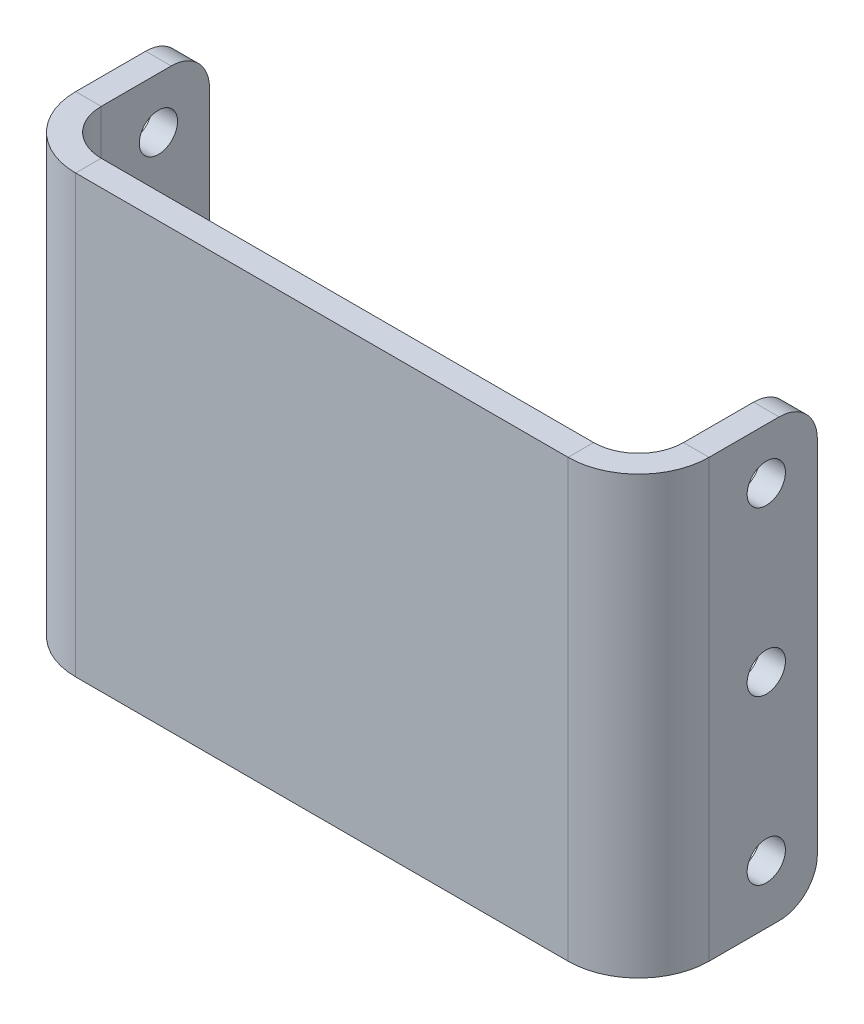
ISO-10303-21;
HEADER;
FILE_DESCRIPTION(('STEP AP214'),'2;1');
FILE_NAME('part.step','',(''),(''),'','','');
FILE_SCHEMA(('AUTOMOTIVE_DESIGN { 1 0 10303 214 1 1 1 1 }'));
ENDSEC;
DATA;
#1=APPLICATION_CONTEXT('core data for automotive mechanical design processes');
#2=APPLICATION_PROTOCOL_DEFINITION('international standard','automotive_design',2000,#1);
#3=PRODUCT_CONTEXT('',#1,'mechanical');
#4=PRODUCT('Part','Part','',(#3));
#5=PRODUCT_RELATED_PRODUCT_CATEGORY('part','',(#4));
#6=PRODUCT_DEFINITION_FORMATION('','',#4);
#7=PRODUCT_DEFINITION_CONTEXT('part definition',#1,'design');
#8=PRODUCT_DEFINITION('design','',#6,#7);
#9=PRODUCT_DEFINITION_SHAPE('','',#8);
#10=(LENGTH_UNIT() NAMED_UNIT(*) SI_UNIT(.MILLI.,.METRE.));
#11=(NAMED_UNIT(*) PLANE_ANGLE_UNIT() SI_UNIT($,.RADIAN.));
#12=(NAMED_UNIT(*) SI_UNIT($,.STERADIAN.) SOLID_ANGLE_UNIT());
#13=UNCERTAINTY_MEASURE_WITH_UNIT(LENGTH_MEASURE(1.E-05),#10,'distance_accuracy_value','');
#14=(GEOMETRIC_REPRESENTATION_CONTEXT(3) GLOBAL_UNCERTAINTY_ASSIGNED_CONTEXT((#13)) GLOBAL_UNIT_ASSIGNED_CONTEXT((#10,
#11,#12)) REPRESENTATION_CONTEXT('',''));
#15=CARTESIAN_POINT('',(0.,0.,0.));
#16=DIRECTION('',(0.,0.,1.));
#17=DIRECTION('',(1.,0.,0.));
#18=AXIS2_PLACEMENT_3D('',#15,#16,#17);
#19=CARTESIAN_POINT('',(-81.9149999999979,395.548937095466,3.175));
#20=DIRECTION('',(0.,1.,0.));
#21=DIRECTION('',(0.,0.,1.));
#22=AXIS2_PLACEMENT_3D('',#19,#20,#21);
#23=PLANE('',#22);
#24=DIRECTION('',(0.,0.,1.));
#25=VECTOR('',#24,1.);
#26=CARTESIAN_POINT('',(-11.9379999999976,395.548937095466,0.));
#27=LINE('',#26,#25);
#28=CARTESIAN_POINT('',(-11.9379999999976,395.548937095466,0.));
#29=VERTEX_POINT('',#28);
#30=CARTESIAN_POINT('',(-11.9379999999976,395.548937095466,3.175));
#31=VERTEX_POINT('',#30);
#32=EDGE_CURVE('E240',#29,#31,#27,.T.);
#33=ORIENTED_EDGE('',*,*,#32,.T.);
#34=DIRECTION('',(1.,0.,0.));
#35=VECTOR('',#34,1.);
#36=CARTESIAN_POINT('',(-81.9149999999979,395.548937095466,3.175));
#37=LINE('',#36,#35);
#38=CARTESIAN_POINT('',(-73.1519999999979,395.548937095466,3.175));
#39=VERTEX_POINT('',#38);
#40=EDGE_CURVE('E302',#39,#31,#37,.T.);
#41=ORIENTED_EDGE('',*,*,#40,.F.);
#42=DIRECTION('',(0.,0.,1.));
#43=VECTOR('',#42,1.);
#44=CARTESIAN_POINT('',(-73.1519999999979,395.548937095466,0.));
#45=LINE('',#44,#43);
#46=CARTESIAN_POINT('',(-73.1519999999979,395.548937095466,0.));
#47=VERTEX_POINT('',#46);
#48=EDGE_CURVE('E296',#47,#39,#45,.T.);
#49=ORIENTED_EDGE('',*,*,#48,.F.);
#50=DIRECTION('',(1.,0.,0.));
#51=VECTOR('',#50,1.);
#52=CARTESIAN_POINT('',(-81.9149999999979,395.548937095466,0.));
#53=LINE('',#52,#51);
#54=EDGE_CURVE('E299',#47,#29,#53,.T.);
#55=ORIENTED_EDGE('',*,*,#54,.T.);
#56=EDGE_LOOP('',(#33,#41,#49,#55));
#57=FACE_BOUND('',#56,.T.);
#58=ADVANCED_FACE('F77',(#57),#23,.F.);
#59=CARTESIAN_POINT('',(-81.9149999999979,449.803360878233,3.175));
#60=DIRECTION('',(0.,-1.,0.));
#61=DIRECTION('',(0.,0.,-1.));
#62=AXIS2_PLACEMENT_3D('',#59,#60,#61);
#63=PLANE('',#62);
#64=DIRECTION('',(0.,0.,1.));
#65=VECTOR('',#64,1.);
#66=CARTESIAN_POINT('',(-11.9379999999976,449.803360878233,0.));
#67=LINE('',#66,#65);
#68=CARTESIAN_POINT('',(-11.9379999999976,449.803360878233,0.));
#69=VERTEX_POINT('',#68);
#70=CARTESIAN_POINT('',(-11.9379999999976,449.803360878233,3.175));
#71=VERTEX_POINT('',#70);
#72=EDGE_CURVE('E247',#69,#71,#67,.T.);
#73=ORIENTED_EDGE('',*,*,#72,.F.);
#74=DIRECTION('',(-1.,0.,0.));
#75=VECTOR('',#74,1.);
#76=CARTESIAN_POINT('',(-81.9149999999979,449.803360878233,0.));
#77=LINE('',#76,#75);
#78=CARTESIAN_POINT('',(-73.1519999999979,449.803360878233,0.));
#79=VERTEX_POINT('',#78);
#80=EDGE_CURVE('E306',#69,#79,#77,.T.);
#81=ORIENTED_EDGE('',*,*,#80,.T.);
#82=DIRECTION('',(0.,0.,1.));
#83=VECTOR('',#82,1.);
#84=CARTESIAN_POINT('',(-73.1519999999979,449.803360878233,0.));
#85=LINE('',#84,#83);
#86=CARTESIAN_POINT('',(-73.1519999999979,449.803360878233,3.17499999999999));
#87=VERTEX_POINT('',#86);
#88=EDGE_CURVE('E286',#79,#87,#85,.T.);
#89=ORIENTED_EDGE('',*,*,#88,.T.);
#90=DIRECTION('',(-1.,0.,0.));
#91=VECTOR('',#90,1.);
#92=CARTESIAN_POINT('',(-81.9149999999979,449.803360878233,3.175));
#93=LINE('',#92,#91);
#94=EDGE_CURVE('E305',#71,#87,#93,.T.);
#95=ORIENTED_EDGE('',*,*,#94,.F.);
#96=EDGE_LOOP('',(#73,#81,#89,#95));
#97=FACE_BOUND('',#96,.T.);
#98=ADVANCED_FACE('F448',(#97),#63,.F.);
#99=CARTESIAN_POINT('',(0.,0.,3.175));
#100=DIRECTION('',(0.,0.,1.));
#101=DIRECTION('',(1.,0.,0.));
#102=AXIS2_PLACEMENT_3D('',#99,#100,#101);
#103=PLANE('',#102);
#104=ORIENTED_EDGE('',*,*,#40,.T.);
#105=DIRECTION('',(0.,-1.,0.));
#106=VECTOR('',#105,1.);
#107=CARTESIAN_POINT('',(-11.9379999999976,395.548937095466,3.175));
#108=LINE('',#107,#106);
#109=EDGE_CURVE('E201',#31,#71,#108,.F.);
#110=ORIENTED_EDGE('',*,*,#109,.T.);
#111=ORIENTED_EDGE('',*,*,#94,.T.);
#112=DIRECTION('',(0.,1.,0.));
#113=VECTOR('',#112,1.);
#114=CARTESIAN_POINT('',(-73.1519999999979,449.803360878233,3.17499999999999));
#115=LINE('',#114,#113);
#116=EDGE_CURVE('E279',#87,#39,#115,.F.);
#117=ORIENTED_EDGE('',*,*,#116,.T.);
#118=EDGE_LOOP('',(#104,#110,#111,#117));
#119=FACE_BOUND('',#118,.T.);
#120=ADVANCED_FACE('F410',(#119),#103,.T.);
#121=CARTESIAN_POINT('',(0.,0.,0.));
#122=DIRECTION('',(0.,0.,1.));
#123=DIRECTION('',(1.,0.,0.));
#124=AXIS2_PLACEMENT_3D('',#121,#122,#123);
#125=PLANE('',#124);
#126=DIRECTION('',(0.,-1.,0.));
#127=VECTOR('',#126,1.);
#128=CARTESIAN_POINT('',(-11.9379999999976,395.548937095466,0.));
#129=LINE('',#128,#127);
#130=EDGE_CURVE('E244',#29,#69,#129,.F.);
#131=ORIENTED_EDGE('',*,*,#130,.F.);
#132=ORIENTED_EDGE('',*,*,#54,.F.);
#133=DIRECTION('',(0.,1.,0.));
#134=VECTOR('',#133,1.);
#135=CARTESIAN_POINT('',(-73.1519999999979,449.803360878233,0.));
#136=LINE('',#135,#134);
#137=EDGE_CURVE('E292',#79,#47,#136,.F.);
#138=ORIENTED_EDGE('',*,*,#137,.F.);
#139=ORIENTED_EDGE('',*,*,#80,.F.);
#140=EDGE_LOOP('',(#131,#132,#138,#139));
#141=FACE_BOUND('',#140,.T.);
#142=ADVANCED_FACE('F404',(#141),#125,.F.);
#143=CARTESIAN_POINT('',(-73.1519999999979,395.548937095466,-5.588));
#144=DIRECTION('',(0.,-1.,0.));
#145=DIRECTION('',(0.,0.,-1.));
#146=AXIS2_PLACEMENT_3D('',#143,#144,#145);
#147=PLANE('',#146);
#148=DIRECTION('',(1.,0.,0.));
#149=VECTOR('',#148,1.);
#150=CARTESIAN_POINT('',(-81.9149999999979,395.548937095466,-5.58799999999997));
#151=LINE('',#150,#149);
#152=CARTESIAN_POINT('',(-78.7399999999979,395.548937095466,-5.58799999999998));
#153=VERTEX_POINT('',#152);
#154=CARTESIAN_POINT('',(-81.9149999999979,395.548937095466,-5.58799999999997));
#155=VERTEX_POINT('',#154);
#156=EDGE_CURVE('E250',#153,#155,#151,.F.);
#157=ORIENTED_EDGE('',*,*,#156,.F.);
#158=CARTESIAN_POINT('',(-73.1519999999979,395.548937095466,-5.588));
#159=DIRECTION('',(0.,1.,0.));
#160=DIRECTION('',(0.,0.,1.));
#161=AXIS2_PLACEMENT_3D('',#158,#159,#160);
#162=CIRCLE('',#161,5.588);
#163=EDGE_CURVE('E289',#47,#153,#162,.F.);
#164=ORIENTED_EDGE('',*,*,#163,.F.);
#165=ORIENTED_EDGE('',*,*,#48,.T.);
#166=CARTESIAN_POINT('',(-73.1519999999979,395.548937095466,-5.588));
#167=DIRECTION('',(0.,1.,0.));
#168=DIRECTION('',(0.,0.,1.));
#169=AXIS2_PLACEMENT_3D('',#166,#167,#168);
#170=CIRCLE('',#169,8.763);
#171=EDGE_CURVE('E282',#39,#155,#170,.F.);
#172=ORIENTED_EDGE('',*,*,#171,.T.);
#173=EDGE_LOOP('',(#157,#164,#165,#172));
#174=FACE_BOUND('',#173,.T.);
#175=ADVANCED_FACE('F395',(#174),#147,.T.);
#176=CARTESIAN_POINT('',(-73.1519999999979,449.803360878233,-5.588));
#177=DIRECTION('',(0.,-1.,0.));
#178=DIRECTION('',(0.,0.,-1.));
#179=AXIS2_PLACEMENT_3D('',#176,#177,#178);
#180=PLANE('',#179);
#181=CARTESIAN_POINT('',(-73.1519999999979,449.803360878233,-5.588));
#182=DIRECTION('',(0.,1.,0.));
#183=DIRECTION('',(0.,0.,1.));
#184=AXIS2_PLACEMENT_3D('',#181,#182,#183);
#185=CIRCLE('',#184,5.588);
#186=CARTESIAN_POINT('',(-78.7399999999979,449.803360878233,-5.58799999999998));
#187=VERTEX_POINT('',#186);
#188=EDGE_CURVE('E254',#187,#79,#185,.T.);
#189=ORIENTED_EDGE('',*,*,#188,.F.);
#190=DIRECTION('',(1.,0.,0.));
#191=VECTOR('',#190,1.);
#192=CARTESIAN_POINT('',(-78.7399999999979,449.803360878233,-5.58799999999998));
#193=LINE('',#192,#191);
#194=CARTESIAN_POINT('',(-81.9149999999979,449.803360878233,-5.58799999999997));
#195=VERTEX_POINT('',#194);
#196=EDGE_CURVE('E272',#187,#195,#193,.F.);
#197=ORIENTED_EDGE('',*,*,#196,.T.);
#198=CARTESIAN_POINT('',(-73.1519999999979,449.803360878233,-5.588));
#199=DIRECTION('',(0.,1.,0.));
#200=DIRECTION('',(0.,0.,1.));
#201=AXIS2_PLACEMENT_3D('',#198,#199,#200);
#202=CIRCLE('',#201,8.763);
#203=EDGE_CURVE('E283',#195,#87,#202,.T.);
#204=ORIENTED_EDGE('',*,*,#203,.T.);
#205=ORIENTED_EDGE('',*,*,#88,.F.);
#206=EDGE_LOOP('',(#189,#197,#204,#205));
#207=FACE_BOUND('',#206,.T.);
#208=ADVANCED_FACE('F415',(#207),#180,.F.);
#209=CARTESIAN_POINT('',(-73.1519999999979,449.803360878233,-5.588));
#210=DIRECTION('',(0.,1.,0.));
#211=DIRECTION('',(-1.,0.,0.));
#212=AXIS2_PLACEMENT_3D('',#209,#210,#211);
#213=CYLINDRICAL_SURFACE('',#212,8.763);
#214=ORIENTED_EDGE('',*,*,#116,.F.);
#215=ORIENTED_EDGE('',*,*,#203,.F.);
#216=DIRECTION('',(0.,1.,0.));
#217=VECTOR('',#216,1.);
#218=CARTESIAN_POINT('',(-81.9149999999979,395.548937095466,-5.58799999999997));
#219=LINE('',#218,#217);
#220=EDGE_CURVE('E269',#195,#155,#219,.F.);
#221=ORIENTED_EDGE('',*,*,#220,.T.);
#222=ORIENTED_EDGE('',*,*,#171,.F.);
#223=EDGE_LOOP('',(#214,#215,#221,#222));
#224=FACE_BOUND('',#223,.T.);
#225=ADVANCED_FACE('F413',(#224),#213,.T.);
#226=CARTESIAN_POINT('',(-73.1519999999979,449.803360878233,-5.588));
#227=DIRECTION('',(0.,1.,0.));
#228=DIRECTION('',(-1.,0.,0.));
#229=AXIS2_PLACEMENT_3D('',#226,#227,#228);
#230=CYLINDRICAL_SURFACE('',#229,5.588);
#231=ORIENTED_EDGE('',*,*,#137,.T.);
#232=ORIENTED_EDGE('',*,*,#163,.T.);
#233=DIRECTION('',(0.,1.,0.));
#234=VECTOR('',#233,1.);
#235=CARTESIAN_POINT('',(-78.7399999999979,395.548937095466,-5.58799999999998));
#236=LINE('',#235,#234);
#237=EDGE_CURVE('E275',#153,#187,#236,.T.);
#238=ORIENTED_EDGE('',*,*,#237,.T.);
#239=ORIENTED_EDGE('',*,*,#188,.T.);
#240=EDGE_LOOP('',(#231,#232,#238,#239));
#241=FACE_BOUND('',#240,.T.);
#242=ADVANCED_FACE('F398',(#241),#230,.F.);
#243=CARTESIAN_POINT('',(-81.9149999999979,449.803360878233,-19.05));
#244=DIRECTION('',(0.,-1.,0.));
#245=DIRECTION('',(0.,0.,-1.));
#246=AXIS2_PLACEMENT_3D('',#243,#244,#245);
#247=PLANE('',#246);
#248=DIRECTION('',(0.,0.,1.));
#249=VECTOR('',#248,1.);
#250=CARTESIAN_POINT('',(-78.7399999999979,449.803360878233,-19.05));
#251=LINE('',#250,#249);
#252=CARTESIAN_POINT('',(-78.7399999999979,449.803360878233,-14.2875));
#253=VERTEX_POINT('',#252);
#254=EDGE_CURVE('E266',#187,#253,#251,.F.);
#255=ORIENTED_EDGE('',*,*,#254,.T.);
#256=DIRECTION('',(1.,0.,0.));
#257=VECTOR('',#256,1.);
#258=CARTESIAN_POINT('',(-81.9149999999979,449.803360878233,-14.2875));
#259=LINE('',#258,#257);
#260=CARTESIAN_POINT('',(-81.9149999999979,449.803360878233,-14.2875));
#261=VERTEX_POINT('',#260);
#262=EDGE_CURVE('E13',#253,#261,#259,.F.);
#263=ORIENTED_EDGE('',*,*,#262,.T.);
#264=DIRECTION('',(0.,0.,-1.));
#265=VECTOR('',#264,1.);
#266=CARTESIAN_POINT('',(-81.9149999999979,449.803360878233,3.0945789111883E-13));
#267=LINE('',#266,#265);
#268=EDGE_CURVE('E258',#195,#261,#267,.T.);
#269=ORIENTED_EDGE('',*,*,#268,.F.);
#270=ORIENTED_EDGE('',*,*,#196,.F.);
#271=EDGE_LOOP('',(#255,#263,#269,#270));
#272=FACE_BOUND('',#271,.T.);
#273=ADVANCED_FACE('F422',(#272),#247,.F.);
#274=CARTESIAN_POINT('',(-81.9149999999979,395.548937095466,0.));
#275=DIRECTION('',(0.,1.,0.));
#276=DIRECTION('',(0.,0.,1.));
#277=AXIS2_PLACEMENT_3D('',#274,#275,#276);
#278=PLANE('',#277);
#279=DIRECTION('',(0.,0.,1.));
#280=VECTOR('',#279,1.);
#281=CARTESIAN_POINT('',(-81.9149999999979,395.548937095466,3.0945789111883E-13));
#282=LINE('',#281,#280);
#283=CARTESIAN_POINT('',(-81.9149999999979,395.548937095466,-14.2875));
#284=VERTEX_POINT('',#283);
#285=EDGE_CURVE('E252',#284,#155,#282,.T.);
#286=ORIENTED_EDGE('',*,*,#285,.F.);
#287=DIRECTION('',(1.,0.,0.));
#288=VECTOR('',#287,1.);
#289=CARTESIAN_POINT('',(-81.9149999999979,395.548937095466,-14.2875));
#290=LINE('',#289,#288);
#291=CARTESIAN_POINT('',(-78.7399999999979,395.548937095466,-14.2875));
#292=VERTEX_POINT('',#291);
#293=EDGE_CURVE('E309',#284,#292,#290,.T.);
#294=ORIENTED_EDGE('',*,*,#293,.T.);
#295=DIRECTION('',(0.,0.,-1.));
#296=VECTOR('',#295,1.);
#297=CARTESIAN_POINT('',(-78.7399999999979,395.548937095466,0.));
#298=LINE('',#297,#296);
#299=EDGE_CURVE('E261',#292,#153,#298,.F.);
#300=ORIENTED_EDGE('',*,*,#299,.T.);
#301=ORIENTED_EDGE('',*,*,#156,.T.);
#302=EDGE_LOOP('',(#286,#294,#300,#301));
#303=FACE_BOUND('',#302,.T.);
#304=ADVANCED_FACE('F391',(#303),#278,.F.);
#305=CARTESIAN_POINT('',(-81.9149999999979,0.,3.0945789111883E-13));
#306=DIRECTION('',(1.,0.,0.));
#307=DIRECTION('',(0.,0.,-1.));
#308=AXIS2_PLACEMENT_3D('',#305,#306,#307);
#309=PLANE('',#308);
#310=CARTESIAN_POINT('',(-81.914999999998,402.813360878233,-12.7000000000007));
#311=DIRECTION('',(1.,0.,0.));
#312=DIRECTION('',(0.,0.,-1.));
#313=AXIS2_PLACEMENT_3D('',#310,#311,#312);
#314=CIRCLE('',#313,2.38125000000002);
#315=CARTESIAN_POINT('',(-81.9149999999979,402.813360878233,-15.0812500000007));
#316=VERTEX_POINT('',#315);
#317=EDGE_CURVE('E524',#316,#316,#314,.T.);
#318=ORIENTED_EDGE('',*,*,#317,.T.);
#319=EDGE_LOOP('',(#318));
#320=FACE_BOUND('',#319,.T.);
#321=CARTESIAN_POINT('',(-81.914999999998,423.133360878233,-12.7000000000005));
#322=DIRECTION('',(1.,0.,0.));
#323=DIRECTION('',(0.,0.,-1.));
#324=AXIS2_PLACEMENT_3D('',#321,#322,#323);
#325=CIRCLE('',#324,2.38125000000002);
#326=CARTESIAN_POINT('',(-81.9149999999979,423.133360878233,-15.0812500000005));
#327=VERTEX_POINT('',#326);
#328=EDGE_CURVE('E350',#327,#327,#325,.T.);
#329=ORIENTED_EDGE('',*,*,#328,.T.);
#330=EDGE_LOOP('',(#329));
#331=FACE_BOUND('',#330,.T.);
#332=CARTESIAN_POINT('',(-81.914999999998,443.453360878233,-12.7000000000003));
#333=DIRECTION('',(1.,0.,0.));
#334=DIRECTION('',(0.,0.,-1.));
#335=AXIS2_PLACEMENT_3D('',#332,#333,#334);
#336=CIRCLE('',#335,2.38125000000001);
#337=CARTESIAN_POINT('',(-81.9149999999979,443.453360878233,-15.0812500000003));
#338=VERTEX_POINT('',#337);
#339=EDGE_CURVE('E346',#338,#338,#336,.T.);
#340=ORIENTED_EDGE('',*,*,#339,.T.);
#341=EDGE_LOOP('',(#340));
#342=FACE_BOUND('',#341,.T.);
#343=DIRECTION('',(0.,-1.,0.));
#344=VECTOR('',#343,1.);
#345=CARTESIAN_POINT('',(-81.9149999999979,0.,-19.05));
#346=LINE('',#345,#344);
#347=CARTESIAN_POINT('',(-81.9149999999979,445.040860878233,-19.05));
#348=VERTEX_POINT('',#347);
#349=CARTESIAN_POINT('',(-81.9149999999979,400.311437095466,-19.05));
#350=VERTEX_POINT('',#349);
#351=EDGE_CURVE('E255',#348,#350,#346,.T.);
#352=ORIENTED_EDGE('',*,*,#351,.T.);
#353=CARTESIAN_POINT('',(-81.9149999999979,400.311437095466,-14.2875));
#354=DIRECTION('',(1.,0.,0.));
#355=DIRECTION('',(0.,0.,-1.));
#356=AXIS2_PLACEMENT_3D('',#353,#354,#355);
#357=CIRCLE('',#356,4.7625);
#358=EDGE_CURVE('E327',#350,#284,#357,.F.);
#359=ORIENTED_EDGE('',*,*,#358,.T.);
#360=ORIENTED_EDGE('',*,*,#285,.T.);
#361=ORIENTED_EDGE('',*,*,#220,.F.);
#362=ORIENTED_EDGE('',*,*,#268,.T.);
#363=CARTESIAN_POINT('',(-81.9149999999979,445.040860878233,-14.2875));
#364=DIRECTION('',(1.,0.,0.));
#365=DIRECTION('',(0.,0.,-1.));
#366=AXIS2_PLACEMENT_3D('',#363,#364,#365);
#367=CIRCLE('',#366,4.7625);
#368=EDGE_CURVE('E325',#261,#348,#367,.F.);
#369=ORIENTED_EDGE('',*,*,#368,.T.);
#370=EDGE_LOOP('',(#352,#359,#360,#361,#362,#369));
#371=FACE_BOUND('',#370,.T.);
#372=ADVANCED_FACE('F381',(#320,#331,#342,#371),#309,.F.);
#373=CARTESIAN_POINT('',(-78.7399999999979,0.,2.98372437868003E-13));
#374=DIRECTION('',(1.,0.,0.));
#375=DIRECTION('',(0.,0.,-1.));
#376=AXIS2_PLACEMENT_3D('',#373,#374,#375);
#377=PLANE('',#376);
#378=CARTESIAN_POINT('',(-78.7399999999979,402.813360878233,-12.7000000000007));
#379=DIRECTION('',(1.,0.,0.));
#380=DIRECTION('',(0.,0.,-1.));
#381=AXIS2_PLACEMENT_3D('',#378,#379,#380);
#382=CIRCLE('',#381,2.38125000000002);
#383=CARTESIAN_POINT('',(-78.7399999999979,402.813360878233,-15.0812500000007));
#384=VERTEX_POINT('',#383);
#385=EDGE_CURVE('E362',#384,#384,#382,.T.);
#386=ORIENTED_EDGE('',*,*,#385,.F.);
#387=EDGE_LOOP('',(#386));
#388=FACE_BOUND('',#387,.T.);
#389=CARTESIAN_POINT('',(-78.7399999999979,423.133360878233,-12.7000000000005));
#390=DIRECTION('',(1.,0.,0.));
#391=DIRECTION('',(0.,0.,-1.));
#392=AXIS2_PLACEMENT_3D('',#389,#390,#391);
#393=CIRCLE('',#392,2.38125000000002);
#394=CARTESIAN_POINT('',(-78.7399999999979,423.133360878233,-15.0812500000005));
#395=VERTEX_POINT('',#394);
#396=EDGE_CURVE('E349',#395,#395,#393,.T.);
#397=ORIENTED_EDGE('',*,*,#396,.F.);
#398=EDGE_LOOP('',(#397));
#399=FACE_BOUND('',#398,.T.);
#400=CARTESIAN_POINT('',(-78.7399999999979,443.453360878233,-12.7000000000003));
#401=DIRECTION('',(1.,0.,0.));
#402=DIRECTION('',(0.,0.,-1.));
#403=AXIS2_PLACEMENT_3D('',#400,#401,#402);
#404=CIRCLE('',#403,2.38125000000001);
#405=CARTESIAN_POINT('',(-78.7399999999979,443.453360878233,-15.0812500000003));
#406=VERTEX_POINT('',#405);
#407=EDGE_CURVE('E237',#406,#406,#404,.T.);
#408=ORIENTED_EDGE('',*,*,#407,.F.);
#409=EDGE_LOOP('',(#408));
#410=FACE_BOUND('',#409,.T.);
#411=ORIENTED_EDGE('',*,*,#299,.F.);
#412=CARTESIAN_POINT('',(-78.7399999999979,400.311437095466,-14.2875));
#413=DIRECTION('',(1.,0.,0.));
#414=DIRECTION('',(0.,0.,-1.));
#415=AXIS2_PLACEMENT_3D('',#412,#413,#414);
#416=CIRCLE('',#415,4.7625);
#417=CARTESIAN_POINT('',(-78.7399999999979,400.311437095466,-19.05));
#418=VERTEX_POINT('',#417);
#419=EDGE_CURVE('E318',#292,#418,#416,.T.);
#420=ORIENTED_EDGE('',*,*,#419,.T.);
#421=DIRECTION('',(0.,1.,0.));
#422=VECTOR('',#421,1.);
#423=CARTESIAN_POINT('',(-78.7399999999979,395.548937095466,-19.05));
#424=LINE('',#423,#422);
#425=CARTESIAN_POINT('',(-78.7399999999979,445.040860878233,-19.05));
#426=VERTEX_POINT('',#425);
#427=EDGE_CURVE('E263',#426,#418,#424,.F.);
#428=ORIENTED_EDGE('',*,*,#427,.F.);
#429=CARTESIAN_POINT('',(-78.7399999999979,445.040860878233,-14.2875));
#430=DIRECTION('',(1.,0.,0.));
#431=DIRECTION('',(0.,0.,-1.));
#432=AXIS2_PLACEMENT_3D('',#429,#430,#431);
#433=CIRCLE('',#432,4.7625);
#434=EDGE_CURVE('E316',#426,#253,#433,.T.);
#435=ORIENTED_EDGE('',*,*,#434,.T.);
#436=ORIENTED_EDGE('',*,*,#254,.F.);
#437=ORIENTED_EDGE('',*,*,#237,.F.);
#438=EDGE_LOOP('',(#411,#420,#428,#435,#436,#437));
#439=FACE_BOUND('',#438,.T.);
#440=ADVANCED_FACE('F377',(#388,#399,#410,#439),#377,.T.);
#441=CARTESIAN_POINT('',(-81.9149999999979,395.548937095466,-19.05));
#442=DIRECTION('',(0.,0.,1.));
#443=DIRECTION('',(1.,0.,0.));
#444=AXIS2_PLACEMENT_3D('',#441,#442,#443);
#445=PLANE('',#444);
#446=ORIENTED_EDGE('',*,*,#427,.T.);
#447=DIRECTION('',(1.,0.,0.));
#448=VECTOR('',#447,1.);
#449=CARTESIAN_POINT('',(-81.9149999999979,400.311437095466,-19.05));
#450=LINE('',#449,#448);
#451=EDGE_CURVE('E323',#418,#350,#450,.F.);
#452=ORIENTED_EDGE('',*,*,#451,.T.);
#453=ORIENTED_EDGE('',*,*,#351,.F.);
#454=DIRECTION('',(1.,0.,0.));
#455=VECTOR('',#454,1.);
#456=CARTESIAN_POINT('',(-81.9149999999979,445.040860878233,-19.05));
#457=LINE('',#456,#455);
#458=EDGE_CURVE('E320',#348,#426,#457,.T.);
#459=ORIENTED_EDGE('',*,*,#458,.T.);
#460=EDGE_LOOP('',(#446,#452,#453,#459));
#461=FACE_BOUND('',#460,.T.);
#462=ADVANCED_FACE('F380',(#461),#445,.F.);
#463=CARTESIAN_POINT('',(-11.9379999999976,449.803360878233,-5.588));
#464=DIRECTION('',(0.,1.,0.));
#465=DIRECTION('',(0.,0.,1.));
#466=AXIS2_PLACEMENT_3D('',#463,#464,#465);
#467=PLANE('',#466);
#468=DIRECTION('',(-1.,0.,0.));
#469=VECTOR('',#468,1.);
#470=CARTESIAN_POINT('',(-3.17499999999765,449.803360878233,-5.58799999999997));
#471=LINE('',#470,#469);
#472=CARTESIAN_POINT('',(-6.34999999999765,449.803360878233,-5.58799999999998));
#473=VERTEX_POINT('',#472);
#474=CARTESIAN_POINT('',(-3.17499999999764,449.803360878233,-5.58799999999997));
#475=VERTEX_POINT('',#474);
#476=EDGE_CURVE('E234',#473,#475,#471,.F.);
#477=ORIENTED_EDGE('',*,*,#476,.F.);
#478=CARTESIAN_POINT('',(-11.9379999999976,449.803360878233,-5.588));
#479=DIRECTION('',(0.,-1.,0.));
#480=DIRECTION('',(0.,0.,-1.));
#481=AXIS2_PLACEMENT_3D('',#478,#479,#480);
#482=CIRCLE('',#481,5.588);
#483=EDGE_CURVE('E204',#69,#473,#482,.F.);
#484=ORIENTED_EDGE('',*,*,#483,.F.);
#485=ORIENTED_EDGE('',*,*,#72,.T.);
#486=CARTESIAN_POINT('',(-11.9379999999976,449.803360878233,-5.588));
#487=DIRECTION('',(0.,-1.,0.));
#488=DIRECTION('',(0.,0.,-1.));
#489=AXIS2_PLACEMENT_3D('',#486,#487,#488);
#490=CIRCLE('',#489,8.763);
#491=EDGE_CURVE('E239',#71,#475,#490,.F.);
#492=ORIENTED_EDGE('',*,*,#491,.T.);
#493=EDGE_LOOP('',(#477,#484,#485,#492));
#494=FACE_BOUND('',#493,.T.);
#495=ADVANCED_FACE('F471',(#494),#467,.T.);
#496=CARTESIAN_POINT('',(-11.9379999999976,395.548937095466,-5.588));
#497=DIRECTION('',(0.,1.,0.));
#498=DIRECTION('',(0.,0.,1.));
#499=AXIS2_PLACEMENT_3D('',#496,#497,#498);
#500=PLANE('',#499);
#501=CARTESIAN_POINT('',(-11.9379999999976,395.548937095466,-5.588));
#502=DIRECTION('',(0.,-1.,0.));
#503=DIRECTION('',(0.,0.,-1.));
#504=AXIS2_PLACEMENT_3D('',#501,#502,#503);
#505=CIRCLE('',#504,5.588);
#506=CARTESIAN_POINT('',(-6.34999999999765,395.548937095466,-5.58799999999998));
#507=VERTEX_POINT('',#506);
#508=EDGE_CURVE('E211',#507,#29,#505,.T.);
#509=ORIENTED_EDGE('',*,*,#508,.F.);
#510=DIRECTION('',(-1.,0.,0.));
#511=VECTOR('',#510,1.);
#512=CARTESIAN_POINT('',(-6.34999999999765,395.548937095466,-5.58799999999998));
#513=LINE('',#512,#511);
#514=CARTESIAN_POINT('',(-3.17499999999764,395.548937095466,-5.58799999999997));
#515=VERTEX_POINT('',#514);
#516=EDGE_CURVE('E208',#507,#515,#513,.F.);
#517=ORIENTED_EDGE('',*,*,#516,.T.);
#518=CARTESIAN_POINT('',(-11.9379999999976,395.548937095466,-5.588));
#519=DIRECTION('',(0.,-1.,0.));
#520=DIRECTION('',(0.,0.,-1.));
#521=AXIS2_PLACEMENT_3D('',#518,#519,#520);
#522=CIRCLE('',#521,8.763);
#523=EDGE_CURVE('E194',#515,#31,#522,.T.);
#524=ORIENTED_EDGE('',*,*,#523,.T.);
#525=ORIENTED_EDGE('',*,*,#32,.F.);
#526=EDGE_LOOP('',(#509,#517,#524,#525));
#527=FACE_BOUND('',#526,.T.);
#528=ADVANCED_FACE('F209',(#527),#500,.F.);
#529=CARTESIAN_POINT('',(-11.9379999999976,395.548937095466,-5.588));
#530=DIRECTION('',(0.,-1.,0.));
#531=DIRECTION('',(1.,0.,0.));
#532=AXIS2_PLACEMENT_3D('',#529,#530,#531);
#533=CYLINDRICAL_SURFACE('',#532,8.763);
#534=ORIENTED_EDGE('',*,*,#109,.F.);
#535=ORIENTED_EDGE('',*,*,#523,.F.);
#536=DIRECTION('',(0.,-1.,0.));
#537=VECTOR('',#536,1.);
#538=CARTESIAN_POINT('',(-3.17499999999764,449.803360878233,-5.58799999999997));
#539=LINE('',#538,#537);
#540=EDGE_CURVE('E198',#515,#475,#539,.F.);
#541=ORIENTED_EDGE('',*,*,#540,.T.);
#542=ORIENTED_EDGE('',*,*,#491,.F.);
#543=EDGE_LOOP('',(#534,#535,#541,#542));
#544=FACE_BOUND('',#543,.T.);
#545=ADVANCED_FACE('F196',(#544),#533,.T.);
#546=CARTESIAN_POINT('',(-11.9379999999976,395.548937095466,-5.588));
#547=DIRECTION('',(0.,-1.,0.));
#548=DIRECTION('',(1.,0.,0.));
#549=AXIS2_PLACEMENT_3D('',#546,#547,#548);
#550=CYLINDRICAL_SURFACE('',#549,5.588);
#551=ORIENTED_EDGE('',*,*,#130,.T.);
#552=ORIENTED_EDGE('',*,*,#483,.T.);
#553=DIRECTION('',(0.,-1.,0.));
#554=VECTOR('',#553,1.);
#555=CARTESIAN_POINT('',(-6.34999999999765,449.803360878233,-5.58799999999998));
#556=LINE('',#555,#554);
#557=EDGE_CURVE('E213',#473,#507,#556,.T.);
#558=ORIENTED_EDGE('',*,*,#557,.T.);
#559=ORIENTED_EDGE('',*,*,#508,.T.);
#560=EDGE_LOOP('',(#551,#552,#558,#559));
#561=FACE_BOUND('',#560,.T.);
#562=ADVANCED_FACE('F482',(#561),#550,.F.);
#563=CARTESIAN_POINT('',(-3.1749999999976,395.548937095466,-19.05));
#564=DIRECTION('',(0.,1.,0.));
#565=DIRECTION('',(0.,0.,1.));
#566=AXIS2_PLACEMENT_3D('',#563,#564,#565);
#567=PLANE('',#566);
#568=DIRECTION('',(0.,0.,1.));
#569=VECTOR('',#568,1.);
#570=CARTESIAN_POINT('',(-6.3499999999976,395.548937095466,-19.05));
#571=LINE('',#570,#569);
#572=CARTESIAN_POINT('',(-6.34999999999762,395.548937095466,-14.2875));
#573=VERTEX_POINT('',#572);
#574=EDGE_CURVE('E219',#507,#573,#571,.F.);
#575=ORIENTED_EDGE('',*,*,#574,.T.);
#576=DIRECTION('',(-1.,0.,0.));
#577=VECTOR('',#576,1.);
#578=CARTESIAN_POINT('',(-3.17499999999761,395.548937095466,-14.2875));
#579=LINE('',#578,#577);
#580=CARTESIAN_POINT('',(-3.17499999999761,395.548937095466,-14.2875));
#581=VERTEX_POINT('',#580);
#582=EDGE_CURVE('E102',#573,#581,#579,.F.);
#583=ORIENTED_EDGE('',*,*,#582,.T.);
#584=DIRECTION('',(0.,0.,-1.));
#585=VECTOR('',#584,1.);
#586=CARTESIAN_POINT('',(-3.17499999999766,395.548937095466,0.));
#587=LINE('',#586,#585);
#588=EDGE_CURVE('E216',#515,#581,#587,.T.);
#589=ORIENTED_EDGE('',*,*,#588,.F.);
#590=ORIENTED_EDGE('',*,*,#516,.F.);
#591=EDGE_LOOP('',(#575,#583,#589,#590));
#592=FACE_BOUND('',#591,.T.);
#593=ADVANCED_FACE('F221',(#592),#567,.F.);
#594=CARTESIAN_POINT('',(-3.17499999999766,449.803360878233,0.));
#595=DIRECTION('',(0.,-1.,0.));
#596=DIRECTION('',(0.,0.,-1.));
#597=AXIS2_PLACEMENT_3D('',#594,#595,#596);
#598=PLANE('',#597);
#599=DIRECTION('',(0.,0.,1.));
#600=VECTOR('',#599,1.);
#601=CARTESIAN_POINT('',(-3.17499999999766,449.803360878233,0.));
#602=LINE('',#601,#600);
#603=CARTESIAN_POINT('',(-3.17499999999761,449.803360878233,-14.2875));
#604=VERTEX_POINT('',#603);
#605=EDGE_CURVE('E218',#604,#475,#602,.T.);
#606=ORIENTED_EDGE('',*,*,#605,.F.);
#607=DIRECTION('',(-1.,0.,0.));
#608=VECTOR('',#607,1.);
#609=CARTESIAN_POINT('',(-3.17499999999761,449.803360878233,-14.2875));
#610=LINE('',#609,#608);
#611=CARTESIAN_POINT('',(-6.34999999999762,449.803360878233,-14.2875));
#612=VERTEX_POINT('',#611);
#613=EDGE_CURVE('E86',#604,#612,#610,.T.);
#614=ORIENTED_EDGE('',*,*,#613,.T.);
#615=DIRECTION('',(0.,0.,-1.));
#616=VECTOR('',#615,1.);
#617=CARTESIAN_POINT('',(-6.34999999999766,449.803360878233,0.));
#618=LINE('',#617,#616);
#619=EDGE_CURVE('E223',#612,#473,#618,.F.);
#620=ORIENTED_EDGE('',*,*,#619,.T.);
#621=ORIENTED_EDGE('',*,*,#476,.T.);
#622=EDGE_LOOP('',(#606,#614,#620,#621));
#623=FACE_BOUND('',#622,.T.);
#624=ADVANCED_FACE('F489',(#623),#598,.F.);
#625=CARTESIAN_POINT('',(-3.17499999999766,0.,0.));
#626=DIRECTION('',(-1.,0.,0.));
#627=DIRECTION('',(0.,0.,1.));
#628=AXIS2_PLACEMENT_3D('',#625,#626,#627);
#629=PLANE('',#628);
#630=CARTESIAN_POINT('',(-3.17499999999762,402.813360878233,-12.7000000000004));
#631=DIRECTION('',(1.,0.,0.));
#632=DIRECTION('',(0.,0.,-1.));
#633=AXIS2_PLACEMENT_3D('',#630,#631,#632);
#634=CIRCLE('',#633,2.38125000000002);
#635=CARTESIAN_POINT('',(-3.17499999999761,402.813360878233,-15.0812500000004));
#636=VERTEX_POINT('',#635);
#637=EDGE_CURVE('E523',#636,#636,#634,.T.);
#638=ORIENTED_EDGE('',*,*,#637,.F.);
#639=EDGE_LOOP('',(#638));
#640=FACE_BOUND('',#639,.T.);
#641=CARTESIAN_POINT('',(-3.17499999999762,423.133360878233,-12.7000000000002));
#642=DIRECTION('',(1.,0.,0.));
#643=DIRECTION('',(0.,0.,-1.));
#644=AXIS2_PLACEMENT_3D('',#641,#642,#643);
#645=CIRCLE('',#644,2.38125000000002);
#646=CARTESIAN_POINT('',(-3.17499999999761,423.133360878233,-15.0812500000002));
#647=VERTEX_POINT('',#646);
#648=EDGE_CURVE('E357',#647,#647,#645,.T.);
#649=ORIENTED_EDGE('',*,*,#648,.F.);
#650=EDGE_LOOP('',(#649));
#651=FACE_BOUND('',#650,.T.);
#652=CARTESIAN_POINT('',(-3.17499999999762,443.453360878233,-12.7));
#653=DIRECTION('',(1.,0.,0.));
#654=DIRECTION('',(0.,0.,-1.));
#655=AXIS2_PLACEMENT_3D('',#652,#653,#654);
#656=CIRCLE('',#655,2.38125000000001);
#657=CARTESIAN_POINT('',(-3.17499999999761,443.453360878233,-15.08125));
#658=VERTEX_POINT('',#657);
#659=EDGE_CURVE('E354',#658,#658,#656,.T.);
#660=ORIENTED_EDGE('',*,*,#659,.F.);
#661=EDGE_LOOP('',(#660));
#662=FACE_BOUND('',#661,.T.);
#663=ORIENTED_EDGE('',*,*,#588,.T.);
#664=CARTESIAN_POINT('',(-3.17499999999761,400.311437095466,-14.2875));
#665=DIRECTION('',(-1.,0.,0.));
#666=DIRECTION('',(0.,0.,1.));
#667=AXIS2_PLACEMENT_3D('',#664,#665,#666);
#668=CIRCLE('',#667,4.7625);
#669=CARTESIAN_POINT('',(-3.1749999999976,400.311437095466,-19.05));
#670=VERTEX_POINT('',#669);
#671=EDGE_CURVE('E340',#581,#670,#668,.F.);
#672=ORIENTED_EDGE('',*,*,#671,.T.);
#673=DIRECTION('',(0.,1.,0.));
#674=VECTOR('',#673,1.);
#675=CARTESIAN_POINT('',(-3.1749999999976,0.,-19.05));
#676=LINE('',#675,#674);
#677=CARTESIAN_POINT('',(-3.1749999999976,445.040860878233,-19.05));
#678=VERTEX_POINT('',#677);
#679=EDGE_CURVE('E222',#670,#678,#676,.T.);
#680=ORIENTED_EDGE('',*,*,#679,.T.);
#681=CARTESIAN_POINT('',(-3.17499999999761,445.040860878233,-14.2875));
#682=DIRECTION('',(-1.,0.,0.));
#683=DIRECTION('',(0.,0.,1.));
#684=AXIS2_PLACEMENT_3D('',#681,#682,#683);
#685=CIRCLE('',#684,4.7625);
#686=EDGE_CURVE('E94',#678,#604,#685,.F.);
#687=ORIENTED_EDGE('',*,*,#686,.T.);
#688=ORIENTED_EDGE('',*,*,#605,.T.);
#689=ORIENTED_EDGE('',*,*,#540,.F.);
#690=EDGE_LOOP('',(#663,#672,#680,#687,#688,#689));
#691=FACE_BOUND('',#690,.T.);
#692=ADVANCED_FACE('F215',(#640,#651,#662,#691),#629,.F.);
#693=CARTESIAN_POINT('',(-6.34999999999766,0.,0.));
#694=DIRECTION('',(-1.,0.,0.));
#695=DIRECTION('',(0.,0.,1.));
#696=AXIS2_PLACEMENT_3D('',#693,#694,#695);
#697=PLANE('',#696);
#698=CARTESIAN_POINT('',(-6.34999999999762,402.813360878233,-12.7000000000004));
#699=DIRECTION('',(-1.,0.,0.));
#700=DIRECTION('',(0.,0.,1.));
#701=AXIS2_PLACEMENT_3D('',#698,#699,#700);
#702=CIRCLE('',#701,2.38125000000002);
#703=CARTESIAN_POINT('',(-6.34999999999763,402.813360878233,-10.3187500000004));
#704=VERTEX_POINT('',#703);
#705=EDGE_CURVE('E81',#704,#704,#702,.T.);
#706=ORIENTED_EDGE('',*,*,#705,.F.);
#707=EDGE_LOOP('',(#706));
#708=FACE_BOUND('',#707,.T.);
#709=CARTESIAN_POINT('',(-6.34999999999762,423.133360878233,-12.7000000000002));
#710=DIRECTION('',(-1.,0.,0.));
#711=DIRECTION('',(0.,0.,1.));
#712=AXIS2_PLACEMENT_3D('',#709,#710,#711);
#713=CIRCLE('',#712,2.38125000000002);
#714=CARTESIAN_POINT('',(-6.34999999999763,423.133360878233,-10.3187500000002));
#715=VERTEX_POINT('',#714);
#716=EDGE_CURVE('E347',#715,#715,#713,.T.);
#717=ORIENTED_EDGE('',*,*,#716,.F.);
#718=EDGE_LOOP('',(#717));
#719=FACE_BOUND('',#718,.T.);
#720=CARTESIAN_POINT('',(-6.34999999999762,443.453360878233,-12.7));
#721=DIRECTION('',(-1.,0.,0.));
#722=DIRECTION('',(0.,0.,1.));
#723=AXIS2_PLACEMENT_3D('',#720,#721,#722);
#724=CIRCLE('',#723,2.38125000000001);
#725=CARTESIAN_POINT('',(-6.34999999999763,443.453360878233,-10.31875));
#726=VERTEX_POINT('',#725);
#727=EDGE_CURVE('E344',#726,#726,#724,.T.);
#728=ORIENTED_EDGE('',*,*,#727,.F.);
#729=EDGE_LOOP('',(#728));
#730=FACE_BOUND('',#729,.T.);
#731=DIRECTION('',(0.,-1.,0.));
#732=VECTOR('',#731,1.);
#733=CARTESIAN_POINT('',(-6.3499999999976,449.803360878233,-19.05));
#734=LINE('',#733,#732);
#735=CARTESIAN_POINT('',(-6.3499999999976,400.311437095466,-19.05));
#736=VERTEX_POINT('',#735);
#737=CARTESIAN_POINT('',(-6.3499999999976,445.040860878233,-19.05));
#738=VERTEX_POINT('',#737);
#739=EDGE_CURVE('E226',#736,#738,#734,.F.);
#740=ORIENTED_EDGE('',*,*,#739,.F.);
#741=CARTESIAN_POINT('',(-6.34999999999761,400.311437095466,-14.2875));
#742=DIRECTION('',(-1.,0.,0.));
#743=DIRECTION('',(0.,0.,1.));
#744=AXIS2_PLACEMENT_3D('',#741,#742,#743);
#745=CIRCLE('',#744,4.7625);
#746=EDGE_CURVE('E336',#736,#573,#745,.T.);
#747=ORIENTED_EDGE('',*,*,#746,.T.);
#748=ORIENTED_EDGE('',*,*,#574,.F.);
#749=ORIENTED_EDGE('',*,*,#557,.F.);
#750=ORIENTED_EDGE('',*,*,#619,.F.);
#751=CARTESIAN_POINT('',(-6.34999999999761,445.040860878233,-14.2875));
#752=DIRECTION('',(-1.,0.,0.));
#753=DIRECTION('',(0.,0.,1.));
#754=AXIS2_PLACEMENT_3D('',#751,#752,#753);
#755=CIRCLE('',#754,4.7625);
#756=EDGE_CURVE('E334',#612,#738,#755,.T.);
#757=ORIENTED_EDGE('',*,*,#756,.T.);
#758=EDGE_LOOP('',(#740,#747,#748,#749,#750,#757));
#759=FACE_BOUND('',#758,.T.);
#760=ADVANCED_FACE('F443',(#708,#719,#730,#759),#697,.T.);
#761=CARTESIAN_POINT('',(-3.1749999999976,449.803360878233,-19.05));
#762=DIRECTION('',(0.,0.,1.));
#763=DIRECTION('',(1.,0.,0.));
#764=AXIS2_PLACEMENT_3D('',#761,#762,#763);
#765=PLANE('',#764);
#766=ORIENTED_EDGE('',*,*,#679,.F.);
#767=DIRECTION('',(-1.,0.,0.));
#768=VECTOR('',#767,1.);
#769=CARTESIAN_POINT('',(-3.1749999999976,400.311437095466,-19.05));
#770=LINE('',#769,#768);
#771=EDGE_CURVE('E331',#670,#736,#770,.T.);
#772=ORIENTED_EDGE('',*,*,#771,.T.);
#773=ORIENTED_EDGE('',*,*,#739,.T.);
#774=DIRECTION('',(-1.,0.,0.));
#775=VECTOR('',#774,1.);
#776=CARTESIAN_POINT('',(-3.1749999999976,445.040860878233,-19.05));
#777=LINE('',#776,#775);
#778=EDGE_CURVE('E329',#738,#678,#777,.F.);
#779=ORIENTED_EDGE('',*,*,#778,.T.);
#780=EDGE_LOOP('',(#766,#772,#773,#779));
#781=FACE_BOUND('',#780,.T.);
#782=ADVANCED_FACE('F434',(#781),#765,.F.);
#783=CARTESIAN_POINT('',(-81.9149999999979,400.311437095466,-14.2875));
#784=DIRECTION('',(1.,0.,0.));
#785=DIRECTION('',(0.,0.,-1.));
#786=AXIS2_PLACEMENT_3D('',#783,#784,#785);
#787=CYLINDRICAL_SURFACE('',#786,4.7625);
#788=ORIENTED_EDGE('',*,*,#358,.F.);
#789=ORIENTED_EDGE('',*,*,#451,.F.);
#790=ORIENTED_EDGE('',*,*,#419,.F.);
#791=ORIENTED_EDGE('',*,*,#293,.F.);
#792=EDGE_LOOP('',(#788,#789,#790,#791));
#793=FACE_BOUND('',#792,.T.);
#794=ADVANCED_FACE('F431',(#793),#787,.T.);
#795=CARTESIAN_POINT('',(-3.17499999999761,400.311437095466,-14.2875));
#796=DIRECTION('',(-1.,0.,0.));
#797=DIRECTION('',(0.,0.,1.));
#798=AXIS2_PLACEMENT_3D('',#795,#796,#797);
#799=CYLINDRICAL_SURFACE('',#798,4.7625);
#800=ORIENTED_EDGE('',*,*,#671,.F.);
#801=ORIENTED_EDGE('',*,*,#582,.F.);
#802=ORIENTED_EDGE('',*,*,#746,.F.);
#803=ORIENTED_EDGE('',*,*,#771,.F.);
#804=EDGE_LOOP('',(#800,#801,#802,#803));
#805=FACE_BOUND('',#804,.T.);
#806=ADVANCED_FACE('F433',(#805),#799,.T.);
#807=CARTESIAN_POINT('',(-3.17499999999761,445.040860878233,-14.2875));
#808=DIRECTION('',(-1.,0.,0.));
#809=DIRECTION('',(0.,0.,1.));
#810=AXIS2_PLACEMENT_3D('',#807,#808,#809);
#811=CYLINDRICAL_SURFACE('',#810,4.7625);
#812=ORIENTED_EDGE('',*,*,#686,.F.);
#813=ORIENTED_EDGE('',*,*,#778,.F.);
#814=ORIENTED_EDGE('',*,*,#756,.F.);
#815=ORIENTED_EDGE('',*,*,#613,.F.);
#816=EDGE_LOOP('',(#812,#813,#814,#815));
#817=FACE_BOUND('',#816,.T.);
#818=ADVANCED_FACE('F440',(#817),#811,.T.);
#819=CARTESIAN_POINT('',(-81.9149999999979,445.040860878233,-14.2875));
#820=DIRECTION('',(1.,0.,0.));
#821=DIRECTION('',(0.,0.,-1.));
#822=AXIS2_PLACEMENT_3D('',#819,#820,#821);
#823=CYLINDRICAL_SURFACE('',#822,4.7625);
#824=ORIENTED_EDGE('',*,*,#368,.F.);
#825=ORIENTED_EDGE('',*,*,#262,.F.);
#826=ORIENTED_EDGE('',*,*,#434,.F.);
#827=ORIENTED_EDGE('',*,*,#458,.F.);
#828=EDGE_LOOP('',(#824,#825,#826,#827));
#829=FACE_BOUND('',#828,.T.);
#830=ADVANCED_FACE('F79',(#829),#823,.T.);
#831=CARTESIAN_POINT('',(-81.914999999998,443.453360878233,-12.7000000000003));
#832=DIRECTION('',(1.,0.,0.));
#833=DIRECTION('',(0.,0.,-1.));
#834=AXIS2_PLACEMENT_3D('',#831,#832,#833);
#835=CYLINDRICAL_SURFACE('',#834,2.38125000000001);
#836=ORIENTED_EDGE('',*,*,#727,.T.);
#837=EDGE_LOOP('',(#836));
#838=FACE_BOUND('',#837,.T.);
#839=ORIENTED_EDGE('',*,*,#659,.T.);
#840=EDGE_LOOP('',(#839));
#841=FACE_BOUND('',#840,.T.);
#842=ADVANCED_FACE('F500',(#838,#841),#835,.F.);
#843=ORIENTED_EDGE('',*,*,#407,.T.);
#844=EDGE_LOOP('',(#843));
#845=FACE_BOUND('',#844,.T.);
#846=ORIENTED_EDGE('',*,*,#339,.F.);
#847=EDGE_LOOP('',(#846));
#848=FACE_BOUND('',#847,.T.);
#849=ADVANCED_FACE('F374',(#845,#848),#835,.F.);
#850=CARTESIAN_POINT('',(-81.914999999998,423.133360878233,-12.7000000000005));
#851=DIRECTION('',(1.,0.,0.));
#852=DIRECTION('',(0.,0.,-1.));
#853=AXIS2_PLACEMENT_3D('',#850,#851,#852);
#854=CYLINDRICAL_SURFACE('',#853,2.38125000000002);
#855=ORIENTED_EDGE('',*,*,#716,.T.);
#856=EDGE_LOOP('',(#855));
#857=FACE_BOUND('',#856,.T.);
#858=ORIENTED_EDGE('',*,*,#648,.T.);
#859=EDGE_LOOP('',(#858));
#860=FACE_BOUND('',#859,.T.);
#861=ADVANCED_FACE('F504',(#857,#860),#854,.F.);
#862=ORIENTED_EDGE('',*,*,#396,.T.);
#863=EDGE_LOOP('',(#862));
#864=FACE_BOUND('',#863,.T.);
#865=ORIENTED_EDGE('',*,*,#328,.F.);
#866=EDGE_LOOP('',(#865));
#867=FACE_BOUND('',#866,.T.);
#868=ADVANCED_FACE('F507',(#864,#867),#854,.F.);
#869=CARTESIAN_POINT('',(-81.914999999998,402.813360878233,-12.7000000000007));
#870=DIRECTION('',(1.,0.,0.));
#871=DIRECTION('',(0.,0.,-1.));
#872=AXIS2_PLACEMENT_3D('',#869,#870,#871);
#873=CYLINDRICAL_SURFACE('',#872,2.38125000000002);
#874=ORIENTED_EDGE('',*,*,#705,.T.);
#875=EDGE_LOOP('',(#874));
#876=FACE_BOUND('',#875,.T.);
#877=ORIENTED_EDGE('',*,*,#637,.T.);
#878=EDGE_LOOP('',(#877));
#879=FACE_BOUND('',#878,.T.);
#880=ADVANCED_FACE('F508',(#876,#879),#873,.F.);
#881=ORIENTED_EDGE('',*,*,#385,.T.);
#882=EDGE_LOOP('',(#881));
#883=FACE_BOUND('',#882,.T.);
#884=ORIENTED_EDGE('',*,*,#317,.F.);
#885=EDGE_LOOP('',(#884));
#886=FACE_BOUND('',#885,.T.);
#887=ADVANCED_FACE('F510',(#883,#886),#873,.F.);
#888=CLOSED_SHELL('',(#58,#98,#120,#142,#175,#208,#225,#242,#273,#304,#372,#440,#462,#495,#528,
#545,#562,#593,#624,#692,#760,#782,#794,#806,#818,#830,#842,#849,#861,#868,#880,#887));
#889=MANIFOLD_SOLID_BREP('B2',#888);
#890=ADVANCED_BREP_SHAPE_REPRESENTATION('',(#18,#889),#14);
#891=SHAPE_DEFINITION_REPRESENTATION(#9,#890);
ENDSEC;
END-ISO-10303-21;
